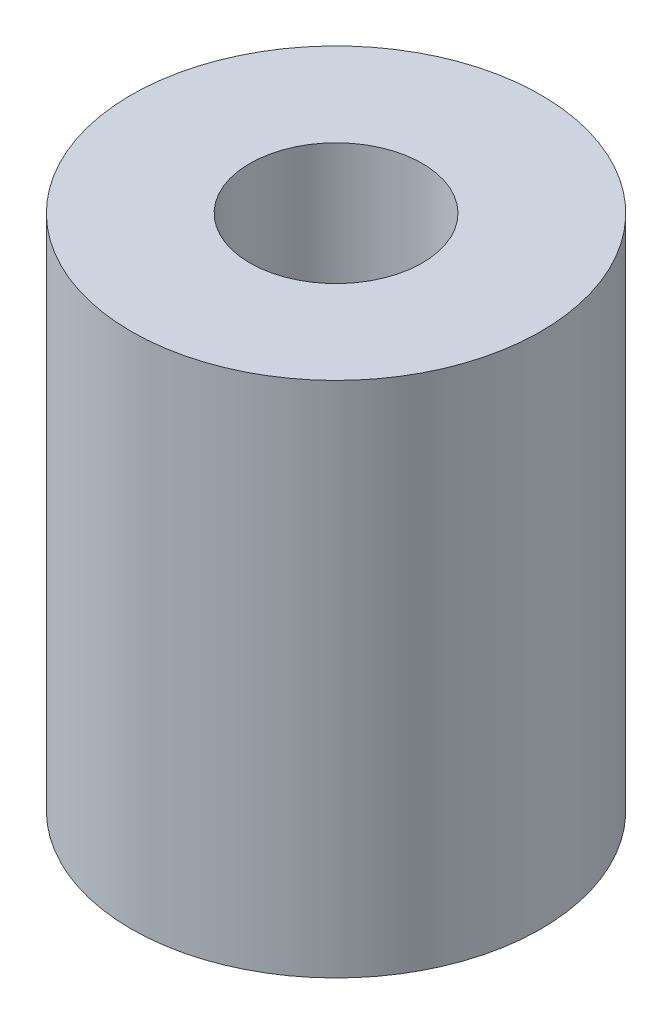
from build123d import *

# Parameters (mm, degrees)
SKETCH1_R           = 9.5
BOSS_EXTRUDE1_DEPTH = 24
SKETCH2_R           = 4
CUT_EXTRUDE1_DEPTH  = 12
SKETCH3_R           = 2.5
CUT_EXTRUDE2_DEPTH  = 12


with BuildPart() as part:
    # Sketch1 → Boss-Extrude1 (new body)
    with BuildSketch(Plane(origin=(0, 0, 0), x_dir=(1, 0, 0), z_dir=(0, 1, 0))):
        with Locations(Location((0, 0, 0), (0, 0, 270))):
            Circle(SKETCH1_R)
    extrude(amount=BOSS_EXTRUDE1_DEPTH)

    # Sketch2 → Cut-Extrude1 (cut)
    with BuildSketch(Plane(origin=(0, 24, 0), x_dir=(1, 0, 0), z_dir=(0, 1, 0))):
        with Locations(Location((0, 0, 0), (0, 0, 270))):
            Circle(SKETCH2_R)
    extrude(amount=-CUT_EXTRUDE1_DEPTH, mode=Mode.SUBTRACT)

    # Sketch3 → Cut-Extrude2 (cut)
    with BuildSketch(Plane.XZ):
        with Locations(Location((0, 0, 0), (0, 0, 270))):
            Circle(SKETCH3_R)
    extrude(amount=-CUT_EXTRUDE2_DEPTH, mode=Mode.SUBTRACT)


solid = part.part
